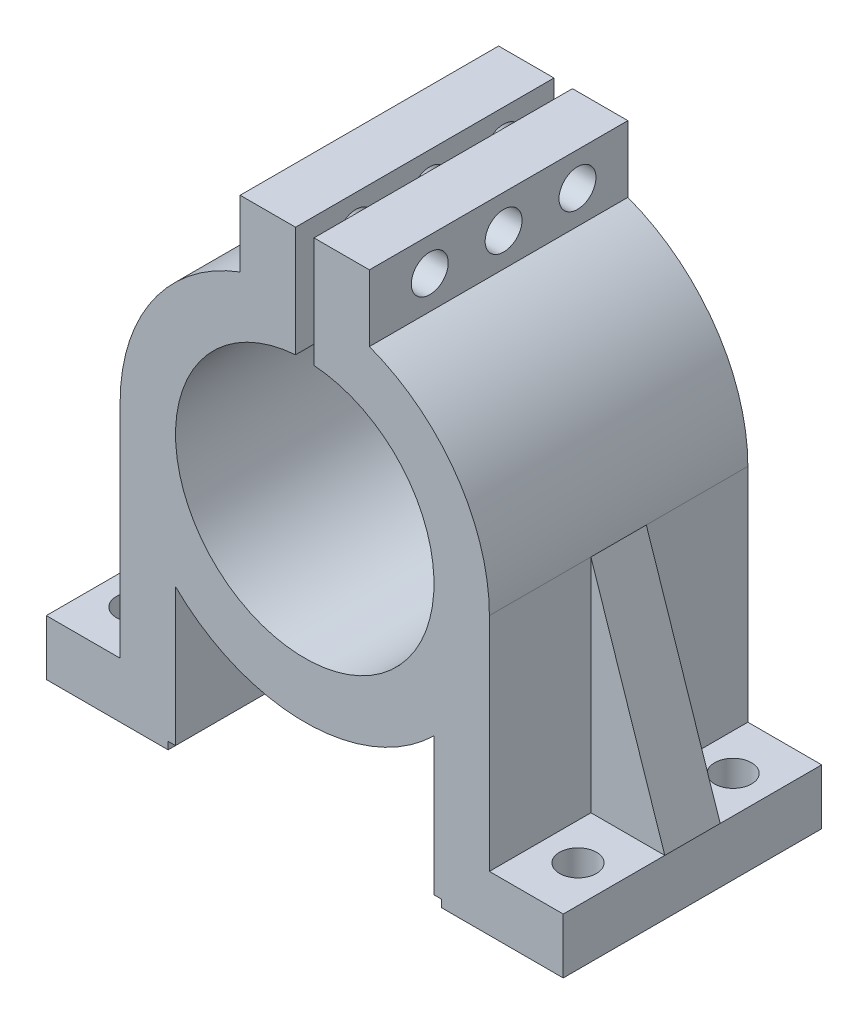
from build123d import *

# Parameters (mm, degrees)
SALIENTE_EXTRUIR1_DEPTH   = 7
SALIENTE_EXTRUIR3_DEPTH   = 1.5
CROQUIS5_R                = 1
CORTAR_EXTRUIR1_DEPTH     = 3
SIMETR_A3_COPY_1_SKETCH_R = 1
SIMETR_A3_COPY_1_DEPTH    = 3
CROQUIS6_R                = 1
CORTAR_EXTRUIR2_DEPTH     = 25.088378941


with BuildPart() as part:
    # Croquis1 → Saliente-Extruir1 (new, symmetric)
    with BuildSketch(Plane.XY):
        with BuildLine():
            Line((-10, 0), (-10, -12))
            Line((-10, -12), (-14, -12))
            Line((-14, -12), (-14, -15))
            Line((-14, -15), (-7.4, -15))
            Line((-7.4, -15), (-7.4, -14.6))
            Line((-7.4, -14.6), (-7, -14.6))
            Line((-7, -14.6), (-7, -7.141428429))
            ThreePointArc((-7, -7.141428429), (0, -10), (7, -7.141428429))
            Line((7, -7.141428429), (7, -14.6))
            Line((7, -14.6), (7.4, -14.6))
            Line((7.4, -14.6), (7.4, -15))
            Line((7.4, -15), (14, -15))
            Line((14, -15), (14, -12))
            Line((14, -12), (10, -12))
            Line((10, -12), (10, 0))
            ThreePointArc((10, 0), (8.215838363, 5.700877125), (3.5, 9.367496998))
            Line((3.5, 9.367496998), (3.5, 12.967496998))
            Line((3.5, 12.967496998), (0.5, 12.967496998))
            Line((0.5, 12.967496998), (0.5, 6.982120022))
            ThreePointArc((0.5, 6.982120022), (0, -7), (-0.5, 6.982120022))
            Line((-0.5, 6.982120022), (-0.5, 12.967496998))
            Line((-0.5, 12.967496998), (-3.5, 12.967496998))
            Line((-3.5, 12.967496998), (-3.5, 9.367496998))
            ThreePointArc((-3.5, 9.367496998), (-8.215838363, 5.700877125), (-10, 0))
        make_face()
    extrude(amount=SALIENTE_EXTRUIR1_DEPTH, both=True)

    # Croquis4 → Saliente-Extruir3 (add, symmetric)
    with BuildSketch(Plane.XY):
        Polygon((-10, -12), (-14, -12), (-10, 0), align=None)
    saliente_extruir3 = extrude(amount=SALIENTE_EXTRUIR3_DEPTH, both=True)

    # Simetr_a1: Saliente-Extruir3 across plane
    add(saliente_extruir3.mirror(Plane(origin=(0, 0, 0), x_dir=(0, 0, 1), z_dir=(1, 0, 0))))

    # Croquis5 → Cortar-Extruir1 (cut)
    with BuildSketch(Plane(origin=(0, -12, 0), x_dir=(1, 0, 0), z_dir=(0, 1, 0))):
        with Locations(Location((-12, 4.2, 0), (0, 0, 270))):
            Circle(CROQUIS5_R)
    cortar_extruir1 = extrude(amount=-CORTAR_EXTRUIR1_DEPTH, mode=Mode.SUBTRACT)

    # Simetr_a2: Cortar-Extruir1 across plane
    add(cortar_extruir1.mirror(Plane.XY), mode=Mode.SUBTRACT)

    # Simetr_a3: Cortar-Extruir1 across plane
    add(cortar_extruir1.mirror(Plane(origin=(0, 0, 0), x_dir=(0, 0, 1), z_dir=(1, 0, 0))), mode=Mode.SUBTRACT)

    # Simetr_a3 copy 1 sketch → Simetr_a3 copy 1 (cut)
    with BuildSketch(Plane(origin=(0, -12, 0), x_dir=(-1, 0, 0), z_dir=(0, 1, 0))):
        with Locations(Location((-12, 4.2, 0), (0, 0, 270))):
            Circle(SIMETR_A3_COPY_1_SKETCH_R)
    extrude(amount=-SIMETR_A3_COPY_1_DEPTH, mode=Mode.SUBTRACT)

    # Croquis6 → Cortar-Extruir2 (cut, through all)
    with BuildSketch(Plane.ZY.offset(3.5)):
        with Locations(Location((-4.271121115, 11.167496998, 0), (0, 0, 270))):
            Circle(CROQUIS6_R)
        with Locations(Location((-0.271121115, 11.167496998, 0), (0, 0, 270))):
            Circle(CROQUIS6_R)
        with Locations(Location((3.728878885, 11.167496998, 0), (0, 0, 270))):
            Circle(CROQUIS6_R)
    extrude(amount=-CORTAR_EXTRUIR2_DEPTH, mode=Mode.SUBTRACT)


solid = part.part
